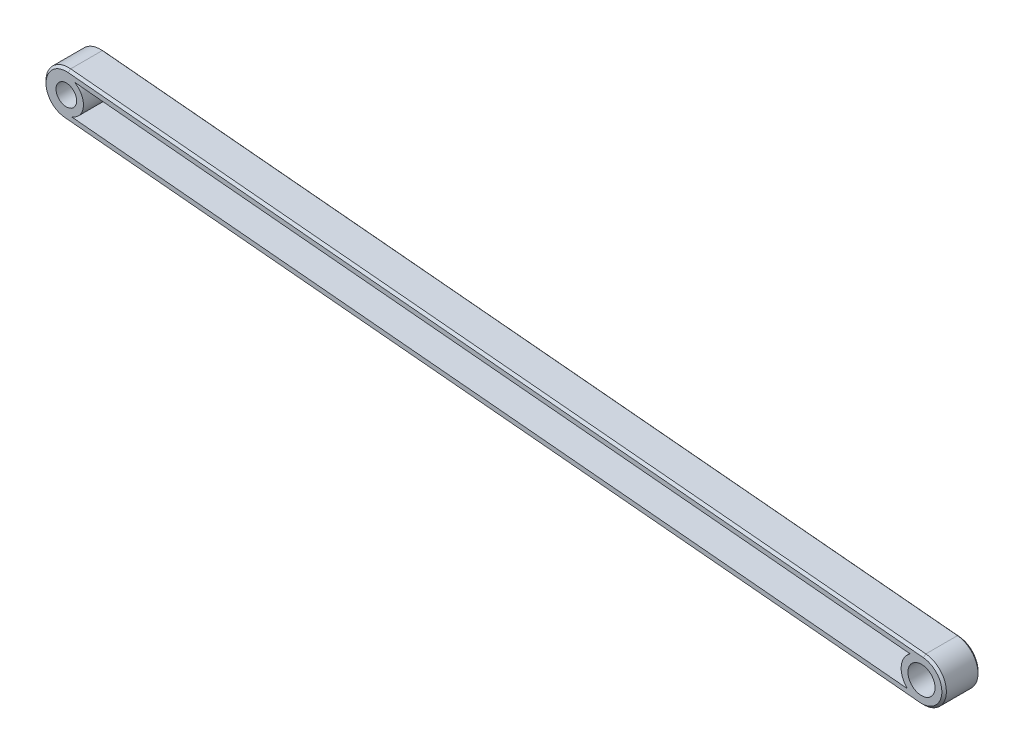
from build123d import *

# Parameters (mm, degrees)
ESQUISSE1_R          = 4.573790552
ESQUISSE1_R_2        = 6
BASE_EXTRUSION_DEPTH = 16
COQUE1_T             = -3
CHANFREIN1_SIZE      = 1


with BuildPart() as part:
    # Esquisse1 → Base-Extrusion (new body)
    with BuildSketch(Plane.XY):
        with BuildLine():
            Line((140.455490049, 974.787256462), (518.841175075, 939.79763847))
            ThreePointArc((518.841175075, 939.79763847), (527.877913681, 928.919341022), (516.999616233, 919.882602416))
            Line((516.999616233, 919.882602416), (138.613931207, 954.872220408))
            ThreePointArc((138.613931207, 954.872220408), (129.577192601, 965.750517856), (140.455490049, 974.787256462))
        make_face()
        with Locations(Location((139.534710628, 964.829738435, 0), (0, 0, 270))):
            Circle(ESQUISSE1_R, mode=Mode.SUBTRACT)
        with Locations(Location((517.920395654, 929.840120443, 0), (0, 0, 270))):
            Circle(ESQUISSE1_R_2, mode=Mode.SUBTRACT)
    extrude(amount=BASE_EXTRUSION_DEPTH)

    # Coque1
    coque1_openings = [part.faces().sort_by_distance(p)[0] for p in [
        (327.568804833, 947.442079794, 16),
    ]]
    offset(amount=COQUE1_T, openings=coque1_openings, kind=Kind.INTERSECTION)

    # Chanfrein1
    chanfrein1_edges = [part.edges().sort_by_distance(p)[0] for p in [
        (329.648332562, 957.292447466, 16),
        (129.577192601, 965.750517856, 16),
        (327.80677372, 937.377411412, 16),
        (527.877913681, 928.919341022, 16),
        (329.648332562, 957.292447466, 0),
        (527.877913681, 928.919341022, 0),
        (327.80677372, 937.377411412, 0),
        (129.577192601, 965.750517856, 0),
    ]]
    chamfer(chanfrein1_edges, length=CHANFREIN1_SIZE)


solid = part.part
